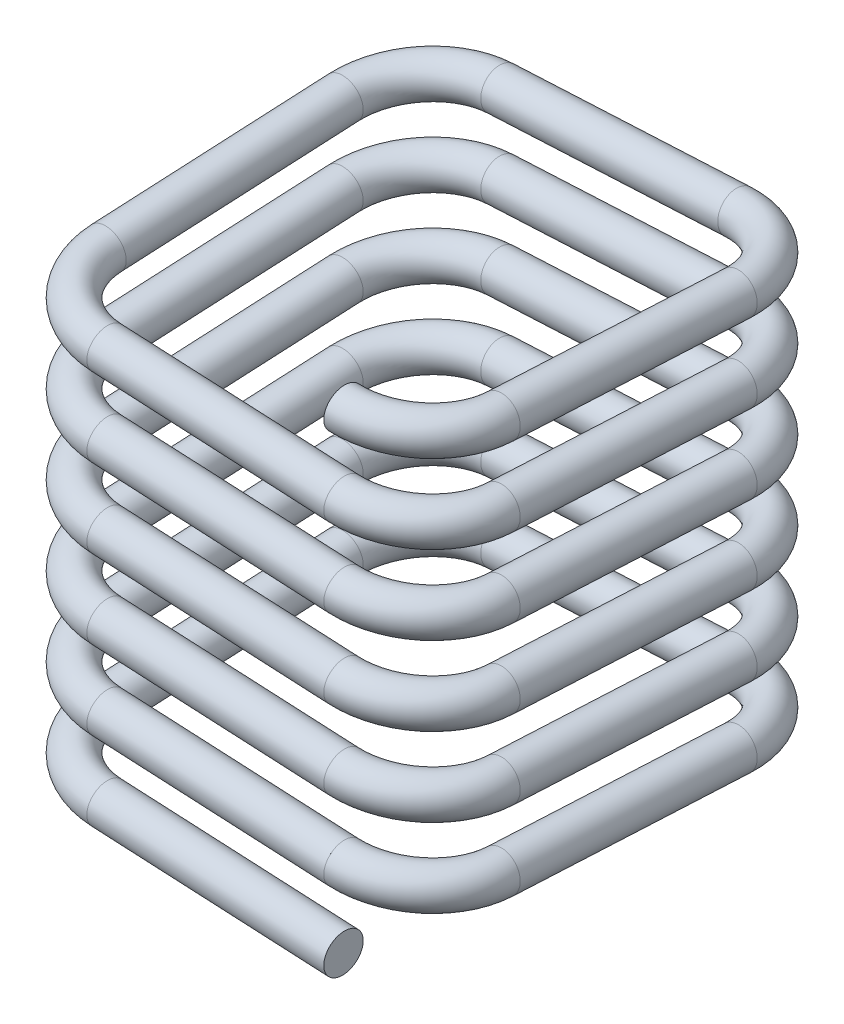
from build123d import *

# Parameters (mm, degrees)
SKIZZE3_R              = 5
LINEARES_MUSTER1_COUNT = 6
LINEARES_MUSTER1_PITCH = 20


with BuildPart() as part:
    # Austragung1: sweep along a curve in space
    with BuildLine() as austragung1_path:
        Line((30.07470435, 0.996264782, 50), (-30.07470435, 4.003735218, 50))
        ThreePointArc((-30.07470435, 4.003735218, 50), (-44.167026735, 5, 44.167026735), (-50, 5.996264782, 30.07470435))
        Line((-50, 5.996264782, 30.07470435), (-50, 9.003735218, -30.07470435))
        ThreePointArc((-50, 9.003735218, -30.07470435), (-44.167026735, 10, -44.167026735), (-30.07470435, 10.996264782, -50))
        Line((-30.07470435, 10.996264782, -50), (30.07470435, 14.003735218, -50))
        ThreePointArc((30.07470435, 14.003735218, -50), (44.167026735, 15, -44.167026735), (50, 15.996264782, -30.07470435))
        Line((50, 15.996264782, -30.07470435), (50, 19.003735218, 30.07470435))
        ThreePointArc((50, 19.003735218, 30.07470435), (44.167026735, 20, 44.167026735), (30.07470435, 20.996264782, 50))
    # Skizze3 → Austragung1 (sweep)
    with BuildSketch(Plane(origin=(30.07470435, 0.996264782, 50), x_dir=(0, 0, 1), z_dir=(-0.9987523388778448, 0.0499376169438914, 0))):
        Circle(SKIZZE3_R)
    sweep(path=austragung1_path.line)


with BuildPart() as lineares_muster1_1:
    # Lineares Muster1: pattern copy
    add(part.part.moved(Location(Vector(0, 1, 0) * (1 * LINEARES_MUSTER1_PITCH))))


with BuildPart() as lineares_muster1_2:
    # Lineares Muster1: pattern copy
    add(part.part.moved(Location(Vector(0, 1, 0) * (2 * LINEARES_MUSTER1_PITCH))))


with BuildPart() as lineares_muster1_3:
    # Lineares Muster1: pattern copy
    add(part.part.moved(Location(Vector(0, 1, 0) * (3 * LINEARES_MUSTER1_PITCH))))


with BuildPart() as lineares_muster1_4:
    # Lineares Muster1: pattern copy
    add(part.part.moved(Location(Vector(0, 1, 0) * (4 * LINEARES_MUSTER1_PITCH))))


with BuildPart() as lineares_muster1_5:
    # Lineares Muster1: pattern copy
    add(part.part.moved(Location(Vector(0, 1, 0) * (5 * LINEARES_MUSTER1_PITCH))))


solid = Compound([part.part, lineares_muster1_1.part, lineares_muster1_2.part, lineares_muster1_3.part, lineares_muster1_4.part, lineares_muster1_5.part])
